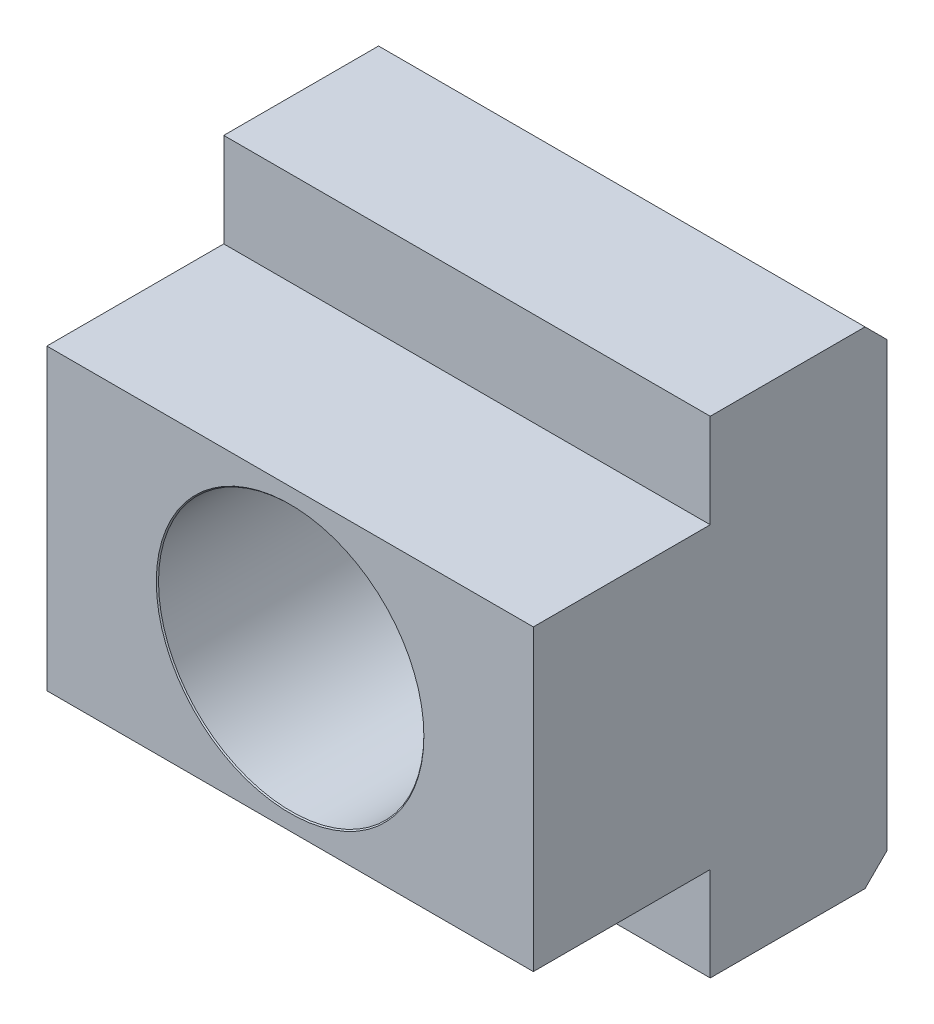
ISO-10303-21;
HEADER;
FILE_DESCRIPTION(('STEP AP214'),'2;1');
FILE_NAME('part.step','',(''),(''),'','','');
FILE_SCHEMA(('AUTOMOTIVE_DESIGN { 1 0 10303 214 1 1 1 1 }'));
ENDSEC;
DATA;
#1=APPLICATION_CONTEXT('core data for automotive mechanical design processes');
#2=APPLICATION_PROTOCOL_DEFINITION('international standard','automotive_design',2000,#1);
#3=PRODUCT_CONTEXT('',#1,'mechanical');
#4=PRODUCT('Part','Part','',(#3));
#5=PRODUCT_RELATED_PRODUCT_CATEGORY('part','',(#4));
#6=PRODUCT_DEFINITION_FORMATION('','',#4);
#7=PRODUCT_DEFINITION_CONTEXT('part definition',#1,'design');
#8=PRODUCT_DEFINITION('design','',#6,#7);
#9=PRODUCT_DEFINITION_SHAPE('','',#8);
#10=(LENGTH_UNIT() NAMED_UNIT(*) SI_UNIT(.MILLI.,.METRE.));
#11=(NAMED_UNIT(*) PLANE_ANGLE_UNIT() SI_UNIT($,.RADIAN.));
#12=(NAMED_UNIT(*) SI_UNIT($,.STERADIAN.) SOLID_ANGLE_UNIT());
#13=UNCERTAINTY_MEASURE_WITH_UNIT(LENGTH_MEASURE(1.E-05),#10,'distance_accuracy_value','');
#14=(GEOMETRIC_REPRESENTATION_CONTEXT(3) GLOBAL_UNCERTAINTY_ASSIGNED_CONTEXT((#13)) GLOBAL_UNIT_ASSIGNED_CONTEXT((#10,
#11,#12)) REPRESENTATION_CONTEXT('',''));
#15=CARTESIAN_POINT('',(0.,0.,0.));
#16=DIRECTION('',(0.,0.,1.));
#17=DIRECTION('',(1.,0.,0.));
#18=AXIS2_PLACEMENT_3D('',#15,#16,#17);
#19=CARTESIAN_POINT('',(-11.,-11.,-8.));
#20=DIRECTION('',(0.,1.,0.));
#21=DIRECTION('',(-1.,0.,0.));
#22=AXIS2_PLACEMENT_3D('',#19,#20,#21);
#23=PLANE('',#22);
#24=DIRECTION('',(0.,0.,1.));
#25=VECTOR('',#24,1.);
#26=CARTESIAN_POINT('',(-11.,-11.,-8.));
#27=LINE('',#26,#25);
#28=CARTESIAN_POINT('',(-11.,-11.,-7.));
#29=VERTEX_POINT('',#28);
#30=CARTESIAN_POINT('',(-11.,-11.,0.));
#31=VERTEX_POINT('',#30);
#32=EDGE_CURVE('E36',#29,#31,#27,.T.);
#33=ORIENTED_EDGE('',*,*,#32,.F.);
#34=DIRECTION('',(1.,0.,0.));
#35=VECTOR('',#34,1.);
#36=CARTESIAN_POINT('',(-11.,-11.,-7.));
#37=LINE('',#36,#35);
#38=CARTESIAN_POINT('',(11.,-11.,-7.));
#39=VERTEX_POINT('',#38);
#40=EDGE_CURVE('E9',#29,#39,#37,.T.);
#41=ORIENTED_EDGE('',*,*,#40,.T.);
#42=DIRECTION('',(0.,0.,1.));
#43=VECTOR('',#42,1.);
#44=CARTESIAN_POINT('',(11.,-11.,-8.));
#45=LINE('',#44,#43);
#46=CARTESIAN_POINT('',(11.,-11.,0.));
#47=VERTEX_POINT('',#46);
#48=EDGE_CURVE('E24',#39,#47,#45,.T.);
#49=ORIENTED_EDGE('',*,*,#48,.T.);
#50=DIRECTION('',(1.,0.,0.));
#51=VECTOR('',#50,1.);
#52=CARTESIAN_POINT('',(-11.,-11.,0.));
#53=LINE('',#52,#51);
#54=EDGE_CURVE('E180',#31,#47,#53,.T.);
#55=ORIENTED_EDGE('',*,*,#54,.F.);
#56=EDGE_LOOP('',(#33,#41,#49,#55));
#57=FACE_BOUND('',#56,.T.);
#58=ADVANCED_FACE('F14',(#57),#23,.F.);
#59=CARTESIAN_POINT('',(-11.,-11.,0.));
#60=DIRECTION('',(0.,0.,-1.));
#61=DIRECTION('',(1.,0.,0.));
#62=AXIS2_PLACEMENT_3D('',#59,#60,#61);
#63=PLANE('',#62);
#64=DIRECTION('',(0.,1.,0.));
#65=VECTOR('',#64,1.);
#66=CARTESIAN_POINT('',(11.,-11.,0.));
#67=LINE('',#66,#65);
#68=CARTESIAN_POINT('',(11.,-6.75,0.));
#69=VERTEX_POINT('',#68);
#70=EDGE_CURVE('E148',#47,#69,#67,.T.);
#71=ORIENTED_EDGE('',*,*,#70,.T.);
#72=DIRECTION('',(1.,0.,0.));
#73=VECTOR('',#72,1.);
#74=CARTESIAN_POINT('',(-11.,-6.75,0.));
#75=LINE('',#74,#73);
#76=CARTESIAN_POINT('',(-11.,-6.75,0.));
#77=VERTEX_POINT('',#76);
#78=EDGE_CURVE('E107',#77,#69,#75,.T.);
#79=ORIENTED_EDGE('',*,*,#78,.F.);
#80=DIRECTION('',(0.,1.,0.));
#81=VECTOR('',#80,1.);
#82=CARTESIAN_POINT('',(-11.,-11.,0.));
#83=LINE('',#82,#81);
#84=EDGE_CURVE('E117',#31,#77,#83,.T.);
#85=ORIENTED_EDGE('',*,*,#84,.F.);
#86=ORIENTED_EDGE('',*,*,#54,.T.);
#87=EDGE_LOOP('',(#71,#79,#85,#86));
#88=FACE_BOUND('',#87,.T.);
#89=ADVANCED_FACE('F247',(#88),#63,.F.);
#90=CARTESIAN_POINT('',(-11.,-6.75,0.));
#91=DIRECTION('',(0.,1.,0.));
#92=DIRECTION('',(-1.,0.,0.));
#93=AXIS2_PLACEMENT_3D('',#90,#91,#92);
#94=PLANE('',#93);
#95=DIRECTION('',(0.,0.,1.));
#96=VECTOR('',#95,1.);
#97=CARTESIAN_POINT('',(11.,-6.75,0.));
#98=LINE('',#97,#96);
#99=CARTESIAN_POINT('',(11.,-6.75,8.));
#100=VERTEX_POINT('',#99);
#101=EDGE_CURVE('E183',#69,#100,#98,.T.);
#102=ORIENTED_EDGE('',*,*,#101,.T.);
#103=DIRECTION('',(1.,0.,0.));
#104=VECTOR('',#103,1.);
#105=CARTESIAN_POINT('',(-11.,-6.75,8.));
#106=LINE('',#105,#104);
#107=CARTESIAN_POINT('',(-11.,-6.75,8.));
#108=VERTEX_POINT('',#107);
#109=EDGE_CURVE('E166',#108,#100,#106,.T.);
#110=ORIENTED_EDGE('',*,*,#109,.F.);
#111=DIRECTION('',(0.,0.,1.));
#112=VECTOR('',#111,1.);
#113=CARTESIAN_POINT('',(-11.,-6.75,0.));
#114=LINE('',#113,#112);
#115=EDGE_CURVE('E149',#77,#108,#114,.T.);
#116=ORIENTED_EDGE('',*,*,#115,.F.);
#117=ORIENTED_EDGE('',*,*,#78,.T.);
#118=EDGE_LOOP('',(#102,#110,#116,#117));
#119=FACE_BOUND('',#118,.T.);
#120=ADVANCED_FACE('F249',(#119),#94,.F.);
#121=CARTESIAN_POINT('',(-11.,-6.75,8.));
#122=DIRECTION('',(0.,0.,-1.));
#123=DIRECTION('',(1.,0.,0.));
#124=AXIS2_PLACEMENT_3D('',#121,#122,#123);
#125=PLANE('',#124);
#126=CARTESIAN_POINT('',(0.,0.,8.));
#127=DIRECTION('',(0.,0.,1.));
#128=DIRECTION('',(-1.,0.,0.));
#129=AXIS2_PLACEMENT_3D('',#126,#127,#128);
#130=CIRCLE('',#129,6.05);
#131=CARTESIAN_POINT('',(-6.05,0.,8.));
#132=VERTEX_POINT('',#131);
#133=EDGE_CURVE('E130',#132,#132,#130,.T.);
#134=ORIENTED_EDGE('',*,*,#133,.F.);
#135=EDGE_LOOP('',(#134));
#136=FACE_BOUND('',#135,.T.);
#137=DIRECTION('',(0.,1.,0.));
#138=VECTOR('',#137,1.);
#139=CARTESIAN_POINT('',(11.,-6.75,8.));
#140=LINE('',#139,#138);
#141=CARTESIAN_POINT('',(11.,6.75,8.));
#142=VERTEX_POINT('',#141);
#143=EDGE_CURVE('E169',#100,#142,#140,.T.);
#144=ORIENTED_EDGE('',*,*,#143,.T.);
#145=DIRECTION('',(1.,0.,0.));
#146=VECTOR('',#145,1.);
#147=CARTESIAN_POINT('',(-11.,6.75,8.));
#148=LINE('',#147,#146);
#149=CARTESIAN_POINT('',(-11.,6.75,8.));
#150=VERTEX_POINT('',#149);
#151=EDGE_CURVE('E159',#150,#142,#148,.T.);
#152=ORIENTED_EDGE('',*,*,#151,.F.);
#153=DIRECTION('',(0.,1.,0.));
#154=VECTOR('',#153,1.);
#155=CARTESIAN_POINT('',(-11.,-6.75,8.));
#156=LINE('',#155,#154);
#157=EDGE_CURVE('E151',#108,#150,#156,.T.);
#158=ORIENTED_EDGE('',*,*,#157,.F.);
#159=ORIENTED_EDGE('',*,*,#109,.T.);
#160=EDGE_LOOP('',(#144,#152,#158,#159));
#161=FACE_BOUND('',#160,.T.);
#162=ADVANCED_FACE('F131',(#136,#161),#125,.F.);
#163=CARTESIAN_POINT('',(-11.,6.75,0.));
#164=DIRECTION('',(0.,-1.,0.));
#165=DIRECTION('',(0.,0.,1.));
#166=AXIS2_PLACEMENT_3D('',#163,#164,#165);
#167=PLANE('',#166);
#168=DIRECTION('',(0.,0.,-1.));
#169=VECTOR('',#168,1.);
#170=CARTESIAN_POINT('',(11.,6.75,0.));
#171=LINE('',#170,#169);
#172=CARTESIAN_POINT('',(11.,6.75,0.));
#173=VERTEX_POINT('',#172);
#174=EDGE_CURVE('E170',#142,#173,#171,.T.);
#175=ORIENTED_EDGE('',*,*,#174,.T.);
#176=DIRECTION('',(1.,0.,0.));
#177=VECTOR('',#176,1.);
#178=CARTESIAN_POINT('',(-11.,6.75,0.));
#179=LINE('',#178,#177);
#180=CARTESIAN_POINT('',(-11.,6.75,0.));
#181=VERTEX_POINT('',#180);
#182=EDGE_CURVE('E160',#181,#173,#179,.T.);
#183=ORIENTED_EDGE('',*,*,#182,.F.);
#184=DIRECTION('',(0.,0.,-1.));
#185=VECTOR('',#184,1.);
#186=CARTESIAN_POINT('',(-11.,6.75,0.));
#187=LINE('',#186,#185);
#188=EDGE_CURVE('E154',#150,#181,#187,.T.);
#189=ORIENTED_EDGE('',*,*,#188,.F.);
#190=ORIENTED_EDGE('',*,*,#151,.T.);
#191=EDGE_LOOP('',(#175,#183,#189,#190));
#192=FACE_BOUND('',#191,.T.);
#193=ADVANCED_FACE('F256',(#192),#167,.F.);
#194=CARTESIAN_POINT('',(-11.,11.,0.));
#195=DIRECTION('',(0.,0.,-1.));
#196=DIRECTION('',(1.,0.,0.));
#197=AXIS2_PLACEMENT_3D('',#194,#195,#196);
#198=PLANE('',#197);
#199=DIRECTION('',(0.,1.,0.));
#200=VECTOR('',#199,1.);
#201=CARTESIAN_POINT('',(11.,11.,0.));
#202=LINE('',#201,#200);
#203=CARTESIAN_POINT('',(11.,11.,0.));
#204=VERTEX_POINT('',#203);
#205=EDGE_CURVE('E155',#173,#204,#202,.T.);
#206=ORIENTED_EDGE('',*,*,#205,.T.);
#207=DIRECTION('',(1.,0.,0.));
#208=VECTOR('',#207,1.);
#209=CARTESIAN_POINT('',(-11.,11.,0.));
#210=LINE('',#209,#208);
#211=CARTESIAN_POINT('',(-11.,11.,0.));
#212=VERTEX_POINT('',#211);
#213=EDGE_CURVE('E175',#212,#204,#210,.T.);
#214=ORIENTED_EDGE('',*,*,#213,.F.);
#215=DIRECTION('',(0.,1.,0.));
#216=VECTOR('',#215,1.);
#217=CARTESIAN_POINT('',(-11.,11.,0.));
#218=LINE('',#217,#216);
#219=EDGE_CURVE('E171',#181,#212,#218,.T.);
#220=ORIENTED_EDGE('',*,*,#219,.F.);
#221=ORIENTED_EDGE('',*,*,#182,.T.);
#222=EDGE_LOOP('',(#206,#214,#220,#221));
#223=FACE_BOUND('',#222,.T.);
#224=ADVANCED_FACE('F261',(#223),#198,.F.);
#225=CARTESIAN_POINT('',(-11.,11.,-8.));
#226=DIRECTION('',(0.,-1.,0.));
#227=DIRECTION('',(0.,0.,1.));
#228=AXIS2_PLACEMENT_3D('',#225,#226,#227);
#229=PLANE('',#228);
#230=DIRECTION('',(0.,0.,-1.));
#231=VECTOR('',#230,1.);
#232=CARTESIAN_POINT('',(11.,11.,-8.));
#233=LINE('',#232,#231);
#234=CARTESIAN_POINT('',(11.,11.,-7.));
#235=VERTEX_POINT('',#234);
#236=EDGE_CURVE('E207',#204,#235,#233,.T.);
#237=ORIENTED_EDGE('',*,*,#236,.T.);
#238=DIRECTION('',(-1.,0.,0.));
#239=VECTOR('',#238,1.);
#240=CARTESIAN_POINT('',(-11.,11.,-7.));
#241=LINE('',#240,#239);
#242=CARTESIAN_POINT('',(-11.,11.,-7.));
#243=VERTEX_POINT('',#242);
#244=EDGE_CURVE('E178',#235,#243,#241,.T.);
#245=ORIENTED_EDGE('',*,*,#244,.T.);
#246=DIRECTION('',(0.,0.,-1.));
#247=VECTOR('',#246,1.);
#248=CARTESIAN_POINT('',(-11.,11.,-8.));
#249=LINE('',#248,#247);
#250=EDGE_CURVE('E165',#212,#243,#249,.T.);
#251=ORIENTED_EDGE('',*,*,#250,.F.);
#252=ORIENTED_EDGE('',*,*,#213,.T.);
#253=EDGE_LOOP('',(#237,#245,#251,#252));
#254=FACE_BOUND('',#253,.T.);
#255=ADVANCED_FACE('F280',(#254),#229,.F.);
#256=CARTESIAN_POINT('',(-11.,11.,-8.));
#257=DIRECTION('',(0.,0.,1.));
#258=DIRECTION('',(0.,-1.,0.));
#259=AXIS2_PLACEMENT_3D('',#256,#257,#258);
#260=PLANE('',#259);
#261=CARTESIAN_POINT('',(0.,0.,-8.));
#262=DIRECTION('',(0.,0.,1.));
#263=DIRECTION('',(-1.,0.,0.));
#264=AXIS2_PLACEMENT_3D('',#261,#262,#263);
#265=CIRCLE('',#264,6.);
#266=CARTESIAN_POINT('',(-6.,0.,-8.));
#267=VERTEX_POINT('',#266);
#268=EDGE_CURVE('E145',#267,#267,#265,.T.);
#269=ORIENTED_EDGE('',*,*,#268,.T.);
#270=EDGE_LOOP('',(#269));
#271=FACE_BOUND('',#270,.T.);
#272=DIRECTION('',(0.,-1.,0.));
#273=VECTOR('',#272,1.);
#274=CARTESIAN_POINT('',(11.,11.,-8.));
#275=LINE('',#274,#273);
#276=CARTESIAN_POINT('',(11.,10.,-8.));
#277=VERTEX_POINT('',#276);
#278=CARTESIAN_POINT('',(11.,-10.,-8.));
#279=VERTEX_POINT('',#278);
#280=EDGE_CURVE('E179',#277,#279,#275,.T.);
#281=ORIENTED_EDGE('',*,*,#280,.T.);
#282=DIRECTION('',(-1.,0.,0.));
#283=VECTOR('',#282,1.);
#284=CARTESIAN_POINT('',(-11.,-10.,-8.));
#285=LINE('',#284,#283);
#286=CARTESIAN_POINT('',(-11.,-10.,-8.));
#287=VERTEX_POINT('',#286);
#288=EDGE_CURVE('E194',#279,#287,#285,.T.);
#289=ORIENTED_EDGE('',*,*,#288,.T.);
#290=DIRECTION('',(0.,-1.,0.));
#291=VECTOR('',#290,1.);
#292=CARTESIAN_POINT('',(-11.,11.,-8.));
#293=LINE('',#292,#291);
#294=CARTESIAN_POINT('',(-11.,10.,-8.));
#295=VERTEX_POINT('',#294);
#296=EDGE_CURVE('E217',#295,#287,#293,.T.);
#297=ORIENTED_EDGE('',*,*,#296,.F.);
#298=DIRECTION('',(1.,0.,0.));
#299=VECTOR('',#298,1.);
#300=CARTESIAN_POINT('',(-11.,10.,-8.));
#301=LINE('',#300,#299);
#302=EDGE_CURVE('E198',#295,#277,#301,.T.);
#303=ORIENTED_EDGE('',*,*,#302,.T.);
#304=EDGE_LOOP('',(#281,#289,#297,#303));
#305=FACE_BOUND('',#304,.T.);
#306=ADVANCED_FACE('F272',(#271,#305),#260,.F.);
#307=CARTESIAN_POINT('',(-11.,-11.,0.));
#308=DIRECTION('',(-1.,0.,0.));
#309=DIRECTION('',(0.,-1.,0.));
#310=AXIS2_PLACEMENT_3D('',#307,#308,#309);
#311=PLANE('',#310);
#312=ORIENTED_EDGE('',*,*,#296,.T.);
#313=DIRECTION('',(0.,-0.707106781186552,0.707106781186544));
#314=VECTOR('',#313,1.);
#315=CARTESIAN_POINT('',(-11.,-14.5,-3.5));
#316=LINE('',#315,#314);
#317=EDGE_CURVE('E200',#287,#29,#316,.T.);
#318=ORIENTED_EDGE('',*,*,#317,.T.);
#319=ORIENTED_EDGE('',*,*,#32,.T.);
#320=ORIENTED_EDGE('',*,*,#84,.T.);
#321=ORIENTED_EDGE('',*,*,#115,.T.);
#322=ORIENTED_EDGE('',*,*,#157,.T.);
#323=ORIENTED_EDGE('',*,*,#188,.T.);
#324=ORIENTED_EDGE('',*,*,#219,.T.);
#325=ORIENTED_EDGE('',*,*,#250,.T.);
#326=DIRECTION('',(0.,-0.707106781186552,-0.707106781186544));
#327=VECTOR('',#326,1.);
#328=CARTESIAN_POINT('',(-11.,3.49999999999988,-14.5));
#329=LINE('',#328,#327);
#330=EDGE_CURVE('E161',#243,#295,#329,.T.);
#331=ORIENTED_EDGE('',*,*,#330,.T.);
#332=EDGE_LOOP('',(#312,#318,#319,#320,#321,#322,#323,#324,#325,#331));
#333=FACE_BOUND('',#332,.T.);
#334=ADVANCED_FACE('F235',(#333),#311,.T.);
#335=CARTESIAN_POINT('',(11.,-11.,0.));
#336=DIRECTION('',(-1.,0.,0.));
#337=DIRECTION('',(0.,-1.,0.));
#338=AXIS2_PLACEMENT_3D('',#335,#336,#337);
#339=PLANE('',#338);
#340=ORIENTED_EDGE('',*,*,#48,.F.);
#341=DIRECTION('',(0.,0.707106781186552,-0.707106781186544));
#342=VECTOR('',#341,1.);
#343=CARTESIAN_POINT('',(11.,-11.,-7.));
#344=LINE('',#343,#342);
#345=EDGE_CURVE('E142',#39,#279,#344,.T.);
#346=ORIENTED_EDGE('',*,*,#345,.T.);
#347=ORIENTED_EDGE('',*,*,#280,.F.);
#348=DIRECTION('',(0.,0.707106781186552,0.707106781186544));
#349=VECTOR('',#348,1.);
#350=CARTESIAN_POINT('',(11.,10.,-8.));
#351=LINE('',#350,#349);
#352=EDGE_CURVE('E135',#277,#235,#351,.T.);
#353=ORIENTED_EDGE('',*,*,#352,.T.);
#354=ORIENTED_EDGE('',*,*,#236,.F.);
#355=ORIENTED_EDGE('',*,*,#205,.F.);
#356=ORIENTED_EDGE('',*,*,#174,.F.);
#357=ORIENTED_EDGE('',*,*,#143,.F.);
#358=ORIENTED_EDGE('',*,*,#101,.F.);
#359=ORIENTED_EDGE('',*,*,#70,.F.);
#360=EDGE_LOOP('',(#340,#346,#347,#353,#354,#355,#356,#357,#358,#359));
#361=FACE_BOUND('',#360,.T.);
#362=ADVANCED_FACE('F240',(#361),#339,.F.);
#363=CARTESIAN_POINT('',(-11.,-11.,-7.));
#364=DIRECTION('',(0.,0.707106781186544,0.707106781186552));
#365=DIRECTION('',(-1.,0.,0.));
#366=AXIS2_PLACEMENT_3D('',#363,#364,#365);
#367=PLANE('',#366);
#368=ORIENTED_EDGE('',*,*,#317,.F.);
#369=ORIENTED_EDGE('',*,*,#288,.F.);
#370=ORIENTED_EDGE('',*,*,#345,.F.);
#371=ORIENTED_EDGE('',*,*,#40,.F.);
#372=EDGE_LOOP('',(#368,#369,#370,#371));
#373=FACE_BOUND('',#372,.T.);
#374=ADVANCED_FACE('F16',(#373),#367,.F.);
#375=CARTESIAN_POINT('',(-11.,10.,-8.));
#376=DIRECTION('',(0.,-0.707106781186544,0.707106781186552));
#377=DIRECTION('',(1.,0.,0.));
#378=AXIS2_PLACEMENT_3D('',#375,#376,#377);
#379=PLANE('',#378);
#380=ORIENTED_EDGE('',*,*,#330,.F.);
#381=ORIENTED_EDGE('',*,*,#244,.F.);
#382=ORIENTED_EDGE('',*,*,#352,.F.);
#383=ORIENTED_EDGE('',*,*,#302,.F.);
#384=EDGE_LOOP('',(#380,#381,#382,#383));
#385=FACE_BOUND('',#384,.T.);
#386=ADVANCED_FACE('F277',(#385),#379,.F.);
#387=CARTESIAN_POINT('',(0.,0.,8.));
#388=DIRECTION('',(0.,0.,1.));
#389=DIRECTION('',(-1.,0.,0.));
#390=AXIS2_PLACEMENT_3D('',#387,#388,#389);
#391=CONICAL_SURFACE('',#390,6.05,0.7853981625);
#392=CARTESIAN_POINT('',(0.,0.,7.94999999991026));
#393=DIRECTION('',(0.,0.,1.));
#394=DIRECTION('',(-1.,0.,0.));
#395=AXIS2_PLACEMENT_3D('',#392,#393,#394);
#396=CIRCLE('',#395,6.);
#397=CARTESIAN_POINT('',(-6.,0.,7.94999999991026));
#398=VERTEX_POINT('',#397);
#399=EDGE_CURVE('E18',#398,#398,#396,.F.);
#400=ORIENTED_EDGE('',*,*,#399,.T.);
#401=EDGE_LOOP('',(#400));
#402=FACE_BOUND('',#401,.T.);
#403=ORIENTED_EDGE('',*,*,#133,.T.);
#404=EDGE_LOOP('',(#403));
#405=FACE_BOUND('',#404,.T.);
#406=ADVANCED_FACE('F306',(#402,#405),#391,.F.);
#407=CARTESIAN_POINT('',(0.,0.,-8.));
#408=DIRECTION('',(0.,0.,1.));
#409=DIRECTION('',(-1.,0.,0.));
#410=AXIS2_PLACEMENT_3D('',#407,#408,#409);
#411=CYLINDRICAL_SURFACE('',#410,6.);
#412=ORIENTED_EDGE('',*,*,#268,.F.);
#413=EDGE_LOOP('',(#412));
#414=FACE_BOUND('',#413,.T.);
#415=ORIENTED_EDGE('',*,*,#399,.F.);
#416=EDGE_LOOP('',(#415));
#417=FACE_BOUND('',#416,.T.);
#418=ADVANCED_FACE('F301',(#414,#417),#411,.F.);
#419=CLOSED_SHELL('',(#58,#89,#120,#162,#193,#224,#255,#306,#334,#362,#374,#386,#406,#418));
#420=MANIFOLD_SOLID_BREP('B1',#419);
#421=ADVANCED_BREP_SHAPE_REPRESENTATION('',(#18,#420),#14);
#422=SHAPE_DEFINITION_REPRESENTATION(#9,#421);
ENDSEC;
END-ISO-10303-21;
